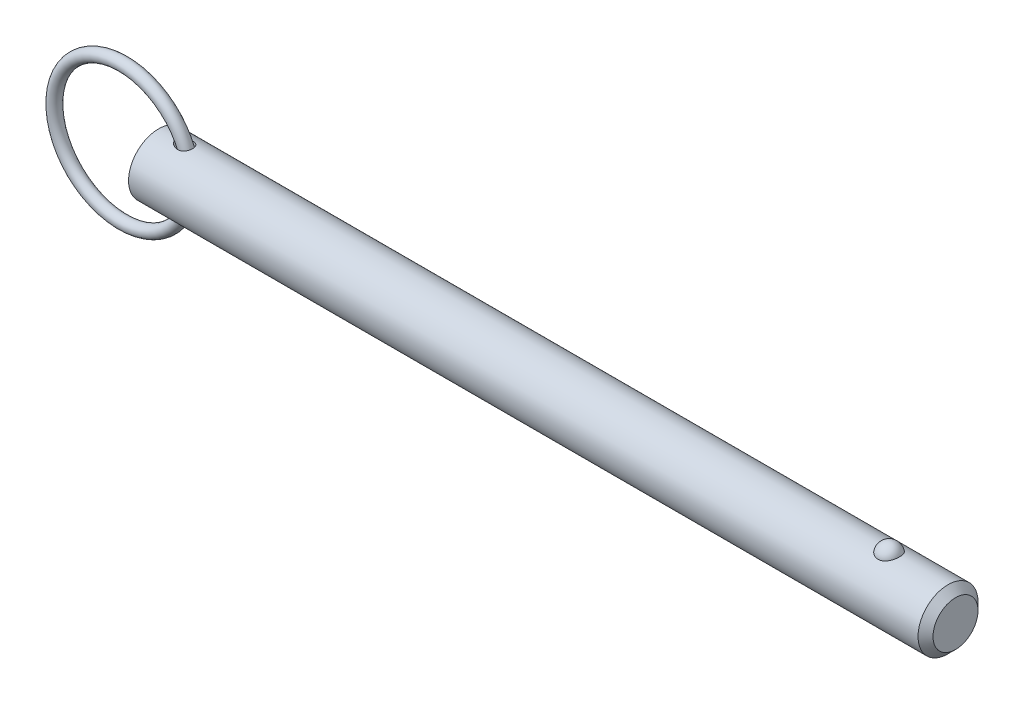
ISO-10303-21;
HEADER;
FILE_DESCRIPTION(('STEP AP214'),'2;1');
FILE_NAME('part.step','',(''),(''),'','','');
FILE_SCHEMA(('AUTOMOTIVE_DESIGN { 1 0 10303 214 1 1 1 1 }'));
ENDSEC;
DATA;
#1=APPLICATION_CONTEXT('core data for automotive mechanical design processes');
#2=APPLICATION_PROTOCOL_DEFINITION('international standard','automotive_design',2000,#1);
#3=PRODUCT_CONTEXT('',#1,'mechanical');
#4=PRODUCT('Part','Part','',(#3));
#5=PRODUCT_RELATED_PRODUCT_CATEGORY('part','',(#4));
#6=PRODUCT_DEFINITION_FORMATION('','',#4);
#7=PRODUCT_DEFINITION_CONTEXT('part definition',#1,'design');
#8=PRODUCT_DEFINITION('design','',#6,#7);
#9=PRODUCT_DEFINITION_SHAPE('','',#8);
#10=(LENGTH_UNIT() NAMED_UNIT(*) SI_UNIT(.MILLI.,.METRE.));
#11=(NAMED_UNIT(*) PLANE_ANGLE_UNIT() SI_UNIT($,.RADIAN.));
#12=(NAMED_UNIT(*) SI_UNIT($,.STERADIAN.) SOLID_ANGLE_UNIT());
#13=UNCERTAINTY_MEASURE_WITH_UNIT(LENGTH_MEASURE(1.E-05),#10,'distance_accuracy_value','');
#14=(GEOMETRIC_REPRESENTATION_CONTEXT(3) GLOBAL_UNCERTAINTY_ASSIGNED_CONTEXT((#13)) GLOBAL_UNIT_ASSIGNED_CONTEXT((#10,
#11,#12)) REPRESENTATION_CONTEXT('',''));
#15=CARTESIAN_POINT('',(0.,0.,0.));
#16=DIRECTION('',(0.,0.,1.));
#17=DIRECTION('',(1.,0.,0.));
#18=AXIS2_PLACEMENT_3D('',#15,#16,#17);
#19=CARTESIAN_POINT('',(-6.5973878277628,0.,0.));
#20=DIRECTION('',(0.,0.,1.));
#21=DIRECTION('',(1.,0.,0.));
#22=AXIS2_PLACEMENT_3D('',#19,#20,#21);
#23=TOROIDAL_SURFACE('',#22,12.7,1.111);
#24=CARTESIAN_POINT('',(7.21361217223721,0.,0.));
#25=VERTEX_POINT('',#24);
#26=VERTEX_LOOP('',#25);
#27=FACE_BOUND('',#26,.T.);
#28=ADVANCED_FACE('P0_F12',(#27),#23,.T.);
#29=CLOSED_SHELL('',(#28));
#30=MANIFOLD_SOLID_BREP('P0_B1',#29);
#31=CARTESIAN_POINT('',(0.,0.,0.));
#32=DIRECTION('',(1.,0.,0.));
#33=DIRECTION('',(0.,0.,-1.));
#34=AXIS2_PLACEMENT_3D('',#31,#32,#33);
#35=CYLINDRICAL_SURFACE('',#34,5.555);
#36=CARTESIAN_POINT('',(3.4079629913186,5.52646850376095,-0.56229074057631));
#37=CARTESIAN_POINT('',(3.45038002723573,5.51879026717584,-0.637753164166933));
#38=CARTESIAN_POINT('',(3.50032814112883,5.50998541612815,-0.70889136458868));
#39=CARTESIAN_POINT('',(3.61174203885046,5.49132550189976,-0.841353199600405));
#40=CARTESIAN_POINT('',(3.67323300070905,5.48146816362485,-0.902654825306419));
#41=CARTESIAN_POINT('',(3.80437942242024,5.46186986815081,-1.01449227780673));
#42=CARTESIAN_POINT('',(3.87396236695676,5.45212862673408,-1.06511378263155));
#43=CARTESIAN_POINT('',(4.01965973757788,5.43359578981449,-1.15594541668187));
#44=CARTESIAN_POINT('',(4.09577226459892,5.42480391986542,-1.19615855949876));
#45=CARTESIAN_POINT('',(4.26620236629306,5.40764958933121,-1.27165209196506));
#46=CARTESIAN_POINT('',(4.36143030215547,5.3996073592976,-1.30496908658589));
#47=CARTESIAN_POINT('',(4.55632904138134,5.38707461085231,-1.35578120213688));
#48=CARTESIAN_POINT('',(4.65600230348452,5.38258608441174,-1.37326745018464));
#49=CARTESIAN_POINT('',(4.85802759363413,5.37803111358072,-1.3910078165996));
#50=CARTESIAN_POINT('',(4.96039620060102,5.37800782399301,-1.39109376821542));
#51=CARTESIAN_POINT('',(5.16321961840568,5.38288845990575,-1.37209481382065));
#52=CARTESIAN_POINT('',(5.2636766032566,5.38778639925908,-1.3530331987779));
#53=CARTESIAN_POINT('',(5.44616808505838,5.40112654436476,-1.29866014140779));
#54=CARTESIAN_POINT('',(5.52893514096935,5.40904875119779,-1.26567968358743));
#55=CARTESIAN_POINT('',(5.68656142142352,5.4273273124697,-1.18484144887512));
#56=CARTESIAN_POINT('',(5.76142575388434,5.43768208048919,-1.13699336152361));
#57=CARTESIAN_POINT('',(5.8928378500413,5.45821422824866,-1.03362464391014));
#58=CARTESIAN_POINT('',(5.95048930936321,5.4682911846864,-0.979480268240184));
#59=CARTESIAN_POINT('',(6.05543937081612,5.48805232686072,-0.861887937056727));
#60=CARTESIAN_POINT('',(6.10274018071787,5.4977365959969,-0.798441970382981));
#61=CARTESIAN_POINT('',(6.18429732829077,5.51527779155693,-0.666351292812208));
#62=CARTESIAN_POINT('',(6.21893047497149,5.52318421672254,-0.597945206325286));
#63=CARTESIAN_POINT('',(6.27643902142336,5.53669785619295,-0.456146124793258));
#64=CARTESIAN_POINT('',(6.299314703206,5.54230512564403,-0.382753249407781));
#65=CARTESIAN_POINT('',(6.33280284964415,5.55061821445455,-0.232999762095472));
#66=CARTESIAN_POINT('',(6.34340498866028,5.55332159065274,-0.156636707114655));
#67=CARTESIAN_POINT('',(6.35208224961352,5.55552923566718,-0.00315477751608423));
#68=CARTESIAN_POINT('',(6.3501570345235,5.55503341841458,0.0739641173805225));
#69=CARTESIAN_POINT('',(6.33379320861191,5.55088854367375,0.22702996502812));
#70=CARTESIAN_POINT('',(6.31931424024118,5.54722931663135,0.302972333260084));
#71=CARTESIAN_POINT('',(6.27810810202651,5.53713917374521,0.451265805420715));
#72=CARTESIAN_POINT('',(6.25138106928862,5.53070828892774,0.523616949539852));
#73=CARTESIAN_POINT('',(6.18634700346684,5.51578851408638,0.662556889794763));
#74=CARTESIAN_POINT('',(6.14805666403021,5.50730259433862,0.729153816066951));
#75=CARTESIAN_POINT('',(6.0608417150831,5.4892059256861,0.854797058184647));
#76=CARTESIAN_POINT('',(6.01191805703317,5.47959527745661,0.91384404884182));
#77=CARTESIAN_POINT('',(5.90496974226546,5.46035411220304,1.0225462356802));
#78=CARTESIAN_POINT('',(5.8469816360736,5.45072382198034,1.07223745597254));
#79=CARTESIAN_POINT('',(5.72342907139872,5.43245016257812,1.16128533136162));
#80=CARTESIAN_POINT('',(5.65786492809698,5.42380675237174,1.20064241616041));
#81=CARTESIAN_POINT('',(5.52033184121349,5.40830592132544,1.26865612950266));
#82=CARTESIAN_POINT('',(5.44830127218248,5.40146883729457,1.2971923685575));
#83=CARTESIAN_POINT('',(5.30051649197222,5.39032432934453,1.34275086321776));
#84=CARTESIAN_POINT('',(5.2247613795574,5.38601752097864,1.35977031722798));
#85=CARTESIAN_POINT('',(5.06697568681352,5.38004503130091,1.3832203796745));
#86=CARTESIAN_POINT('',(4.98483834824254,5.37854992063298,1.38896799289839));
#87=CARTESIAN_POINT('',(4.82062075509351,5.37866467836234,1.38851901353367));
#88=CARTESIAN_POINT('',(4.73854053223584,5.38027567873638,1.38231806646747));
#89=CARTESIAN_POINT('',(4.5665970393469,5.38661928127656,1.35740374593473));
#90=CARTESIAN_POINT('',(4.47694676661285,5.39169506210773,1.33731128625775));
#91=CARTESIAN_POINT('',(4.30168169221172,5.40457769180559,1.28425210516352));
#92=CARTESIAN_POINT('',(4.2160714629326,5.41238755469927,1.25127117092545));
#93=CARTESIAN_POINT('',(4.04117722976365,5.43085841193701,1.16867508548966));
#94=CARTESIAN_POINT('',(3.95261220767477,5.44174460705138,1.11757796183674));
#95=CARTESIAN_POINT('',(3.78568183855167,5.46440376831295,1.00091858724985));
#96=CARTESIAN_POINT('',(3.70730710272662,5.47617590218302,0.935369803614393));
#97=CARTESIAN_POINT('',(3.5829937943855,5.49603821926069,0.809043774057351));
#98=CARTESIAN_POINT('',(3.5339020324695,5.50429522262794,0.751392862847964));
#99=CARTESIAN_POINT('',(3.44556991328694,5.51963490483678,0.628847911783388));
#100=CARTESIAN_POINT('',(3.40631385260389,5.52671944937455,0.563965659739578));
#101=CARTESIAN_POINT('',(3.34553998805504,5.5379053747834,0.439181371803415));
#102=CARTESIAN_POINT('',(3.32216705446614,5.5423057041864,0.380214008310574));
#103=CARTESIAN_POINT('',(3.28543686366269,5.54928356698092,0.259119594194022));
#104=CARTESIAN_POINT('',(3.27207322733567,5.5518622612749,0.196994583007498));
#105=CARTESIAN_POINT('',(3.25633559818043,5.5549036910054,0.0710541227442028));
#106=CARTESIAN_POINT('',(3.25400356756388,5.5553583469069,0.00723314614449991));
#107=CARTESIAN_POINT('',(3.26064251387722,5.55407150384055,-0.119787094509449));
#108=CARTESIAN_POINT('',(3.26961302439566,5.55233009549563,-0.182986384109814));
#109=CARTESIAN_POINT('',(3.29666795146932,5.54714559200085,-0.300518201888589));
#110=CARTESIAN_POINT('',(3.31373453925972,5.54389322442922,-0.355099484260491));
#111=CARTESIAN_POINT('',(3.35543396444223,5.53607951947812,-0.461174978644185));
#112=CARTESIAN_POINT('',(3.38007019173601,5.5315175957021,-0.512667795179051));
#113=CARTESIAN_POINT('',(3.4079629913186,5.52646850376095,-0.56229074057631));
#114=B_SPLINE_CURVE_WITH_KNOTS('',3,(#36,#37,#38,#39,#40,#41,#42,#43,#44,#45,#46,#47,#48,#49,
#50,#51,#52,#53,#54,#55,#56,#57,#58,#59,#60,#61,#62,#63,#64,#65,#66,#67,#68,#69,#70,#71,#72,#73,
#74,#75,#76,#77,#78,#79,#80,#81,#82,#83,#84,#85,#86,#87,#88,#89,#90,#91,#92,#93,#94,#95,#96,#97,
#98,#99,#100,#101,#102,#103,#104,#105,#106,#107,#108,#109,#110,#111,#112,#113),.UNSPECIFIED.,
.T.,.F.,(4,2,2,2,2,2,2,2,2,2,2,2,2,2,2,2,2,2,2,2,2,2,2,2,2,2,2,2,2,2,2,2,2,2,2,2,2,2,4),(0.,
0.260459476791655,0.521493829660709,0.780346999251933,1.03912513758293,1.34137402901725,
1.64379222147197,1.94913302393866,2.25410286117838,2.52092363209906,2.78757087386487,
3.02557563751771,3.26352958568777,3.49368251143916,3.72382991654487,3.9541708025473,
4.18451788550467,4.41560824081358,4.64669600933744,4.87745174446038,5.10818684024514,
5.33801446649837,5.56783253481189,5.80013729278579,6.03249854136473,6.27855081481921,
6.5246927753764,6.79963372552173,7.07487872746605,7.38193573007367,7.68870779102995,
7.91639390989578,8.14371416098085,8.33366541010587,8.52349549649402,8.71404708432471,
8.90459080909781,9.07578823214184,9.24706243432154),.UNSPECIFIED.);
#115=CARTESIAN_POINT('',(3.4079629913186,5.52646850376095,-0.56229074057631));
#116=VERTEX_POINT('',#115);
#117=EDGE_CURVE('P1_E40',#116,#116,#114,.T.);
#118=ORIENTED_EDGE('',*,*,#117,.T.);
#119=EDGE_LOOP('',(#118));
#120=FACE_BOUND('',#119,.T.);
#121=CARTESIAN_POINT('',(146.23125,0.,0.));
#122=DIRECTION('',(1.,0.,0.));
#123=DIRECTION('',(0.,0.,-1.));
#124=AXIS2_PLACEMENT_3D('',#121,#122,#123);
#125=CIRCLE('',#124,5.555);
#126=CARTESIAN_POINT('',(146.23125,0.,-5.555));
#127=VERTEX_POINT('',#126);
#128=EDGE_CURVE('P1_E25',#127,#127,#125,.T.);
#129=ORIENTED_EDGE('',*,*,#128,.F.);
#130=EDGE_LOOP('',(#129));
#131=FACE_BOUND('',#130,.T.);
#132=CARTESIAN_POINT('',(0.,0.,0.));
#133=DIRECTION('',(1.,0.,0.));
#134=DIRECTION('',(0.,0.,-1.));
#135=AXIS2_PLACEMENT_3D('',#132,#133,#134);
#136=CIRCLE('',#135,5.555);
#137=CARTESIAN_POINT('',(0.,0.,-5.555));
#138=VERTEX_POINT('',#137);
#139=EDGE_CURVE('P1_E9',#138,#138,#136,.T.);
#140=ORIENTED_EDGE('',*,*,#139,.T.);
#141=EDGE_LOOP('',(#140));
#142=FACE_BOUND('',#141,.T.);
#143=CARTESIAN_POINT('',(135.318626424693,5.16741224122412,2.03859650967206));
#144=CARTESIAN_POINT('',(135.212949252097,5.16740893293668,2.03859990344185));
#145=CARTESIAN_POINT('',(135.10729894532,5.17079470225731,2.03008306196));
#146=CARTESIAN_POINT('',(134.899141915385,5.18392795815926,1.99630721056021));
#147=CARTESIAN_POINT('',(134.796634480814,5.19367399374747,1.97105201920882));
#148=CARTESIAN_POINT('',(134.597771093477,5.21839168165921,1.90463997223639));
#149=CARTESIAN_POINT('',(134.501406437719,5.23335573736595,1.8635062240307));
#150=CARTESIAN_POINT('',(134.317080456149,5.26688076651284,1.76652592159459));
#151=CARTESIAN_POINT('',(134.229120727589,5.28544242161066,1.71067657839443));
#152=CARTESIAN_POINT('',(134.061265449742,5.32479845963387,1.58399959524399));
#153=CARTESIAN_POINT('',(133.98166564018,5.34564089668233,1.51279545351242));
#154=CARTESIAN_POINT('',(133.83512901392,5.38697258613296,1.35828584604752));
#155=CARTESIAN_POINT('',(133.768194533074,5.40746177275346,1.27497815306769));
#156=CARTESIAN_POINT('',(133.64561039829,5.44694508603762,1.0944029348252));
#157=CARTESIAN_POINT('',(133.590598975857,5.46583143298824,0.996677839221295));
#158=CARTESIAN_POINT('',(133.496937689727,5.49908030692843,0.792961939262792));
#159=CARTESIAN_POINT('',(133.458289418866,5.513442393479,0.686970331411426));
#160=CARTESIAN_POINT('',(133.397680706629,5.53635851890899,0.468019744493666));
#161=CARTESIAN_POINT('',(133.375972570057,5.54482455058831,0.354981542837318));
#162=CARTESIAN_POINT('',(133.350636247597,5.55473324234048,0.126595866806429));
#163=CARTESIAN_POINT('',(133.347007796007,5.55617600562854,0.0112484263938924));
#164=CARTESIAN_POINT('',(133.357881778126,5.55189984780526,-0.21801161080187));
#165=CARTESIAN_POINT('',(133.372315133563,5.54620821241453,-0.331928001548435));
#166=CARTESIAN_POINT('',(133.418903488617,5.52828920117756,-0.555544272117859));
#167=CARTESIAN_POINT('',(133.451058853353,5.5160616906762,-0.665244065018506));
#168=CARTESIAN_POINT('',(133.532488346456,5.48630779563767,-0.877469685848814));
#169=CARTESIAN_POINT('',(133.581781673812,5.4687754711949,-0.979987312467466));
#170=CARTESIAN_POINT('',(133.696478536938,5.43024700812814,-1.17486975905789));
#171=CARTESIAN_POINT('',(133.761883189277,5.4092506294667,-1.26723387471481));
#172=CARTESIAN_POINT('',(133.907571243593,5.36600927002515,-1.4394013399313));
#173=CARTESIAN_POINT('',(133.987885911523,5.34376173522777,-1.51917763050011));
#174=CARTESIAN_POINT('',(134.161452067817,5.30057971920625,-1.66360338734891));
#175=CARTESIAN_POINT('',(134.254702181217,5.27964509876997,-1.72825445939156));
#176=CARTESIAN_POINT('',(134.449393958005,5.24205250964,-1.83909478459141));
#177=CARTESIAN_POINT('',(134.550590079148,5.22530519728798,-1.88568407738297));
#178=CARTESIAN_POINT('',(134.760155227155,5.19750919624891,-1.96100802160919));
#179=CARTESIAN_POINT('',(134.868521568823,5.1864583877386,-1.98974931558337));
#180=CARTESIAN_POINT('',(135.083498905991,5.17184410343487,-2.02742262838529));
#181=CARTESIAN_POINT('',(135.189925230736,5.1679328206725,-2.03727608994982));
#182=CARTESIAN_POINT('',(135.402992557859,5.16698995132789,-2.03966777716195));
#183=CARTESIAN_POINT('',(135.509633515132,5.16995704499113,-2.0322093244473));
#184=CARTESIAN_POINT('',(135.716773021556,5.18222383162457,-2.00071170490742));
#185=CARTESIAN_POINT('',(135.817359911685,5.19133213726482,-1.97717337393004));
#186=CARTESIAN_POINT('',(136.013014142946,5.21467637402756,-1.91475248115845));
#187=CARTESIAN_POINT('',(136.108081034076,5.22891272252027,-1.87586867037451));
#188=CARTESIAN_POINT('',(136.292371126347,5.26137066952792,-1.78282713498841));
#189=CARTESIAN_POINT('',(136.381419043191,5.27967329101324,-1.72835124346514));
#190=CARTESIAN_POINT('',(136.549288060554,5.3181741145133,-1.60597483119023));
#191=CARTESIAN_POINT('',(136.628106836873,5.33837274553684,-1.5380712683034));
#192=CARTESIAN_POINT('',(136.777515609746,5.37968287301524,-1.38688970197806));
#193=CARTESIAN_POINT('',(136.847505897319,5.40079011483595,-1.30301744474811));
#194=CARTESIAN_POINT('',(136.973012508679,5.44074401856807,-1.12458170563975));
#195=CARTESIAN_POINT('',(137.028526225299,5.45959027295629,-1.03001630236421));
#196=CARTESIAN_POINT('',(137.125550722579,5.49369849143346,-0.829439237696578));
#197=CARTESIAN_POINT('',(137.166548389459,5.50882422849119,-0.723155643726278));
#198=CARTESIAN_POINT('',(137.231125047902,5.53310911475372,-0.504772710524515));
#199=CARTESIAN_POINT('',(137.254703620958,5.54226812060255,-0.392673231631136));
#200=CARTESIAN_POINT('',(137.284013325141,5.55370358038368,-0.165459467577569));
#201=CARTESIAN_POINT('',(137.289688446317,5.55595843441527,-0.0503368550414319));
#202=CARTESIAN_POINT('',(137.282916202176,5.55329317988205,0.179288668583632));
#203=CARTESIAN_POINT('',(137.270469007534,5.54837313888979,0.293791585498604));
#204=CARTESIAN_POINT('',(137.227779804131,5.53189037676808,0.518526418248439));
#205=CARTESIAN_POINT('',(137.197598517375,5.5203503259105,0.628771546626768));
#206=CARTESIAN_POINT('',(137.120096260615,5.49182453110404,0.84231815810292));
#207=CARTESIAN_POINT('',(137.072774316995,5.47483847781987,0.945619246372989));
#208=CARTESIAN_POINT('',(136.961720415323,5.43710633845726,1.14281571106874));
#209=CARTESIAN_POINT('',(136.897921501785,5.41634501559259,1.23667048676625));
#210=CARTESIAN_POINT('',(136.755357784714,5.37334572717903,1.4118524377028));
#211=CARTESIAN_POINT('',(136.67659323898,5.35110778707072,1.49317982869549));
#212=CARTESIAN_POINT('',(136.506423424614,5.30779474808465,1.64049162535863));
#213=CARTESIAN_POINT('',(136.41510026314,5.28671324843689,1.7065687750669));
#214=CARTESIAN_POINT('',(136.221739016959,5.24804852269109,1.82201372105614));
#215=CARTESIAN_POINT('',(136.119700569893,5.23046541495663,1.87138095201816));
#216=CARTESIAN_POINT('',(135.903618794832,5.20042692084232,1.95335298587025));
#217=CARTESIAN_POINT('',(135.789260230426,5.18820192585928,1.98521734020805));
#218=CARTESIAN_POINT('',(135.556130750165,5.17169804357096,2.02783294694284));
#219=CARTESIAN_POINT('',(135.437361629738,5.16741595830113,2.03859269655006));
#220=CARTESIAN_POINT('',(135.318626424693,5.16741224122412,2.03859650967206));
#221=B_SPLINE_CURVE_WITH_KNOTS('',3,(#143,#144,#145,#146,#147,#148,#149,#150,#151,#152,#153,
#154,#155,#156,#157,#158,#159,#160,#161,#162,#163,#164,#165,#166,#167,#168,#169,#170,#171,#172,
#173,#174,#175,#176,#177,#178,#179,#180,#181,#182,#183,#184,#185,#186,#187,#188,#189,#190,#191,
#192,#193,#194,#195,#196,#197,#198,#199,#200,#201,#202,#203,#204,#205,#206,#207,#208,#209,#210,
#211,#212,#213,#214,#215,#216,#217,#218,#219,#220),.UNSPECIFIED.,.T.,.F.,(4,2,2,2,2,2,2,2,2,2,2,
2,2,2,2,2,2,2,2,2,2,2,2,2,2,2,2,2,2,2,2,2,2,2,2,2,2,2,4),(0.,0.316595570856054,
0.633118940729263,0.94918341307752,1.26530783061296,1.59030762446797,1.91536729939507,
2.25495824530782,2.59458224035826,2.93917283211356,3.28375835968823,3.62703002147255,
3.97030875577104,4.31397329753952,4.657661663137,5.00207904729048,5.34645984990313,
5.68270547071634,6.01882587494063,6.33808403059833,6.65728093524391,6.9669637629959,
7.27667180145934,7.59321535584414,7.90983070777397,8.24210387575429,8.57443684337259,
8.91755896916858,9.26068933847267,9.60489211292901,9.94909164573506,10.2921194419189,
10.6351667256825,10.9796305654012,11.3240884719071,11.6663928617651,12.0087088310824,
12.3645679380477,12.7202837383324),.UNSPECIFIED.);
#222=CARTESIAN_POINT('',(135.318626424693,5.16741224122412,2.03859650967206));
#223=VERTEX_POINT('',#222);
#224=EDGE_CURVE('P1_E34',#223,#223,#221,.T.);
#225=ORIENTED_EDGE('',*,*,#224,.T.);
#226=EDGE_LOOP('',(#225));
#227=FACE_BOUND('',#226,.T.);
#228=CARTESIAN_POINT('',(3.4079629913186,-5.52646850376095,-0.56229074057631));
#229=CARTESIAN_POINT('',(3.37716927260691,-5.53204268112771,-0.507507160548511));
#230=CARTESIAN_POINT('',(3.35034276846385,-5.53702335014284,-0.450440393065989));
#231=CARTESIAN_POINT('',(3.30606625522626,-5.54534377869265,-0.3326552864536));
#232=CARTESIAN_POINT('',(3.28860803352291,-5.5486849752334,-0.271940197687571));
#233=CARTESIAN_POINT('',(3.26421203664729,-5.55337514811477,-0.148013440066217));
#234=CARTESIAN_POINT('',(3.25732647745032,-5.55471423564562,-0.0847909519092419));
#235=CARTESIAN_POINT('',(3.25480623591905,-5.5552029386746,0.0418913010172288));
#236=CARTESIAN_POINT('',(3.25917102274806,-5.55435265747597,0.105351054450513));
#237=CARTESIAN_POINT('',(3.27824306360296,-5.55067444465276,0.227039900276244));
#238=CARTESIAN_POINT('',(3.29237198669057,-5.54795714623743,0.285365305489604));
#239=CARTESIAN_POINT('',(3.32941044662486,-5.54094262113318,0.399033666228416));
#240=CARTESIAN_POINT('',(3.3523223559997,-5.53664496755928,0.454375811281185));
#241=CARTESIAN_POINT('',(3.40768868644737,-5.52648234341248,0.56509977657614));
#242=CARTESIAN_POINT('',(3.4407252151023,-5.52052470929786,0.620179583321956));
#243=CARTESIAN_POINT('',(3.51400705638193,-5.50771567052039,0.725188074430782));
#244=CARTESIAN_POINT('',(3.55425830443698,-5.50086353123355,0.775112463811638));
#245=CARTESIAN_POINT('',(3.66122818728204,-5.48337209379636,0.891977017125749));
#246=CARTESIAN_POINT('',(3.73142715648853,-5.47248221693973,0.955709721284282));
#247=CARTESIAN_POINT('',(3.88137100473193,-5.45112279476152,1.07085228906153));
#248=CARTESIAN_POINT('',(3.96113047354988,-5.44065392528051,1.12224294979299));
#249=CARTESIAN_POINT('',(4.12858826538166,-5.42121387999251,1.21269344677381));
#250=CARTESIAN_POINT('',(4.21635930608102,-5.41225908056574,1.25162207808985));
#251=CARTESIAN_POINT('',(4.39702156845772,-5.39704895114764,1.31566440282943));
#252=CARTESIAN_POINT('',(4.48991226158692,-5.39079334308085,1.34077951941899));
#253=CARTESIAN_POINT('',(4.68604255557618,-5.38154547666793,1.37745897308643));
#254=CARTESIAN_POINT('',(4.78952677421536,-5.37884317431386,1.38782444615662));
#255=CARTESIAN_POINT('',(4.9967070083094,-5.3783992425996,1.38955482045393));
#256=CARTESIAN_POINT('',(5.10040282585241,-5.380654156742,1.380932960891));
#257=CARTESIAN_POINT('',(5.29344112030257,-5.3896561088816,1.34533259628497));
#258=CARTESIAN_POINT('',(5.38316618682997,-5.39591960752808,1.32032381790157));
#259=CARTESIAN_POINT('',(5.55593681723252,-5.41176992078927,1.25376768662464));
#260=CARTESIAN_POINT('',(5.63898852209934,-5.42135363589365,1.2122357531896));
#261=CARTESIAN_POINT('',(5.78518175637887,-5.4411584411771,1.1197110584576));
#262=CARTESIAN_POINT('',(5.84951468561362,-5.45115126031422,1.07054233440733));
#263=CARTESIAN_POINT('',(5.96832363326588,-5.47143247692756,0.961516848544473));
#264=CARTESIAN_POINT('',(6.02280238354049,-5.48172079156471,0.901663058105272));
#265=CARTESIAN_POINT('',(6.11773365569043,-5.50082367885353,0.776380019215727));
#266=CARTESIAN_POINT('',(6.15876077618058,-5.50968670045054,0.711392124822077));
#267=CARTESIAN_POINT('',(6.22940016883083,-5.52555592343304,0.575278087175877));
#268=CARTESIAN_POINT('',(6.25901321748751,-5.53256225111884,0.504152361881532));
#269=CARTESIAN_POINT('',(6.30603044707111,-5.54392803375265,0.35809068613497));
#270=CARTESIAN_POINT('',(6.32348246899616,-5.54829785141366,0.283170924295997));
#271=CARTESIAN_POINT('',(6.34598368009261,-5.5539654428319,0.131376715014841));
#272=CARTESIAN_POINT('',(6.35103253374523,-5.55526313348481,0.054502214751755));
#273=CARTESIAN_POINT('',(6.34861245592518,-5.55464639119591,-0.0993401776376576));
#274=CARTESIAN_POINT('',(6.34109421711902,-5.5527193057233,-0.176307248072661));
#275=CARTESIAN_POINT('',(6.31360904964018,-5.54583593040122,-0.327847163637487));
#276=CARTESIAN_POINT('',(6.29364207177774,-5.54087962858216,-0.402419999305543));
#277=CARTESIAN_POINT('',(6.24170966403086,-5.52847553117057,-0.54704108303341));
#278=CARTESIAN_POINT('',(6.20974488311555,-5.52102787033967,-0.617089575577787));
#279=CARTESIAN_POINT('',(6.13458425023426,-5.5044595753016,-0.750655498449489));
#280=CARTESIAN_POINT('',(6.09138916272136,-5.49533905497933,-0.814173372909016));
#281=CARTESIAN_POINT('',(5.99508306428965,-5.47647644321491,-0.932642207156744));
#282=CARTESIAN_POINT('',(5.94201288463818,-5.46673701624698,-0.987626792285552));
#283=CARTESIAN_POINT('',(5.82732079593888,-5.4476756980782,-1.08787197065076));
#284=CARTESIAN_POINT('',(5.76569959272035,-5.43835377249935,-1.133133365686));
#285=CARTESIAN_POINT('',(5.63545565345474,-5.42108746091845,-1.2130627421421));
#286=CARTESIAN_POINT('',(5.56680798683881,-5.41314827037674,-1.24769112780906));
#287=CARTESIAN_POINT('',(5.42470366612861,-5.39946749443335,-1.30562834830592));
#288=CARTESIAN_POINT('',(5.3512462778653,-5.39372624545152,-1.32893545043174));
#289=CARTESIAN_POINT('',(5.19834649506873,-5.38471871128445,-1.36498831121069));
#290=CARTESIAN_POINT('',(5.11878242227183,-5.38156800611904,-1.37724301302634));
#291=CARTESIAN_POINT('',(4.95867408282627,-5.37830368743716,-1.38993264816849));
#292=CARTESIAN_POINT('',(4.87812945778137,-5.37819121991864,-1.39036312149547));
#293=CARTESIAN_POINT('',(4.70952450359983,-5.38096665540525,-1.37958681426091));
#294=CARTESIAN_POINT('',(4.62154757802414,-5.38416579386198,-1.36717293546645));
#295=CARTESIAN_POINT('',(4.44844201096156,-5.39350862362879,-1.32983172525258));
#296=CARTESIAN_POINT('',(4.36331534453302,-5.39965431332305,-1.30489590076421));
#297=CARTESIAN_POINT('',(4.18705584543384,-5.41508127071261,-1.23943340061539));
#298=CARTESIAN_POINT('',(4.09653169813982,-5.42466147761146,-1.19732979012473));
#299=CARTESIAN_POINT('',(3.92355621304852,-5.44542654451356,-1.09903394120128));
#300=CARTESIAN_POINT('',(3.84111059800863,-5.45661252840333,-1.04283181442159));
#301=CARTESIAN_POINT('',(3.69303712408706,-5.47835672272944,-0.921492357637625));
#302=CARTESIAN_POINT('',(3.62661543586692,-5.4888999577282,-0.857326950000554));
#303=CARTESIAN_POINT('',(3.50663841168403,-5.50887375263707,-0.717815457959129));
#304=CARTESIAN_POINT('',(3.45304856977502,-5.51830726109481,-0.642500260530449));
#305=CARTESIAN_POINT('',(3.4079629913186,-5.52646850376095,-0.56229074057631));
#306=B_SPLINE_CURVE_WITH_KNOTS('',3,(#228,#229,#230,#231,#232,#233,#234,#235,#236,#237,#238,
#239,#240,#241,#242,#243,#244,#245,#246,#247,#248,#249,#250,#251,#252,#253,#254,#255,#256,#257,
#258,#259,#260,#261,#262,#263,#264,#265,#266,#267,#268,#269,#270,#271,#272,#273,#274,#275,#276,
#277,#278,#279,#280,#281,#282,#283,#284,#285,#286,#287,#288,#289,#290,#291,#292,#293,#294,#295,
#296,#297,#298,#299,#300,#301,#302,#303,#304,#305),.UNSPECIFIED.,.T.,.F.,(4,2,2,2,2,2,2,2,2,2,2,
2,2,2,2,2,2,2,2,2,2,2,2,2,2,2,2,2,2,2,2,2,2,2,2,2,2,2,4),(0.,0.189054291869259,
0.377942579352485,0.567760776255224,0.757570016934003,0.937004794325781,1.11648807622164,
1.30929480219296,1.50226088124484,1.78704908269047,2.07227755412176,2.3604171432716,
2.64852704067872,2.95892962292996,3.26911584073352,3.5475451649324,3.82571526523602,
4.06921935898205,4.31265584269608,4.54364944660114,4.77462733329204,5.00469135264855,
5.23476159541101,5.46573664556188,5.69671260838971,5.92767607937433,6.15862383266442,
6.38863707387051,6.61863134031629,6.84947196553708,7.08034790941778,7.32103794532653,
7.56181876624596,7.82747997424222,8.09332161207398,8.39289891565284,8.69268692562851,
8.97023931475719,9.24703674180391),.UNSPECIFIED.);
#307=CARTESIAN_POINT('',(3.4079629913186,-5.52646850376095,-0.56229074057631));
#308=VERTEX_POINT('',#307);
#309=EDGE_CURVE('P1_E17',#308,#308,#306,.T.);
#310=ORIENTED_EDGE('',*,*,#309,.T.);
#311=EDGE_LOOP('',(#310));
#312=FACE_BOUND('',#311,.T.);
#313=ADVANCED_FACE('P1_F13',(#120,#131,#142,#227,#312),#35,.T.);
#314=CARTESIAN_POINT('',(0.,0.,0.));
#315=DIRECTION('',(-1.,0.,0.));
#316=DIRECTION('',(0.,0.,1.));
#317=AXIS2_PLACEMENT_3D('',#314,#315,#316);
#318=PLANE('',#317);
#319=ORIENTED_EDGE('',*,*,#139,.F.);
#320=EDGE_LOOP('',(#319));
#321=FACE_BOUND('',#320,.T.);
#322=ADVANCED_FACE('P1_F15',(#321),#318,.T.);
#323=CARTESIAN_POINT('',(147.62,0.,0.));
#324=DIRECTION('',(-1.,0.,0.));
#325=DIRECTION('',(0.,0.,1.));
#326=AXIS2_PLACEMENT_3D('',#323,#324,#325);
#327=CONICAL_SURFACE('',#326,4.16625000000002,0.785398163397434);
#328=ORIENTED_EDGE('',*,*,#128,.T.);
#329=EDGE_LOOP('',(#328));
#330=FACE_BOUND('',#329,.T.);
#331=CARTESIAN_POINT('',(147.62,0.,0.));
#332=DIRECTION('',(1.,0.,0.));
#333=DIRECTION('',(0.,0.,-1.));
#334=AXIS2_PLACEMENT_3D('',#331,#332,#333);
#335=CIRCLE('',#334,4.16625000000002);
#336=CARTESIAN_POINT('',(147.62,0.,-4.16625000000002));
#337=VERTEX_POINT('',#336);
#338=EDGE_CURVE('P1_E30',#337,#337,#335,.T.);
#339=ORIENTED_EDGE('',*,*,#338,.F.);
#340=EDGE_LOOP('',(#339));
#341=FACE_BOUND('',#340,.T.);
#342=ADVANCED_FACE('P1_F55',(#330,#341),#327,.T.);
#343=CARTESIAN_POINT('',(147.62,4.16625000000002,0.));
#344=DIRECTION('',(1.,0.,0.));
#345=DIRECTION('',(0.,0.,-1.));
#346=AXIS2_PLACEMENT_3D('',#343,#344,#345);
#347=PLANE('',#346);
#348=ORIENTED_EDGE('',*,*,#338,.T.);
#349=EDGE_LOOP('',(#348));
#350=FACE_BOUND('',#349,.T.);
#351=ADVANCED_FACE('P1_F51',(#350),#347,.T.);
#352=CARTESIAN_POINT('',(135.318626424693,4.9995,0.));
#353=DIRECTION('',(-1.,0.,0.));
#354=DIRECTION('',(0.,1.,0.));
#355=AXIS2_PLACEMENT_3D('',#352,#353,#354);
#356=SPHERICAL_SURFACE('',#355,2.04550000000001);
#357=ORIENTED_EDGE('',*,*,#224,.F.);
#358=EDGE_LOOP('',(#357));
#359=FACE_BOUND('',#358,.T.);
#360=ADVANCED_FACE('P1_F46',(#359),#356,.T.);
#361=CARTESIAN_POINT('',(-6.5973878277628,0.,0.));
#362=DIRECTION('',(0.,0.,1.));
#363=DIRECTION('',(1.,0.,0.));
#364=AXIS2_PLACEMENT_3D('',#361,#362,#363);
#365=TOROIDAL_SURFACE('',#364,12.7,1.38875);
#366=ORIENTED_EDGE('',*,*,#309,.F.);
#367=EDGE_LOOP('',(#366));
#368=FACE_BOUND('',#367,.T.);
#369=ORIENTED_EDGE('',*,*,#117,.F.);
#370=EDGE_LOOP('',(#369));
#371=FACE_BOUND('',#370,.T.);
#372=ADVANCED_FACE('P1_F50',(#368,#371),#365,.F.);
#373=CLOSED_SHELL('',(#313,#322,#342,#351,#360,#372));
#374=MANIFOLD_SOLID_BREP('P1_B1',#373);
#375=ADVANCED_BREP_SHAPE_REPRESENTATION('',(#18,#30,#374),#14);
#376=SHAPE_DEFINITION_REPRESENTATION(#9,#375);
ENDSEC;
END-ISO-10303-21;
